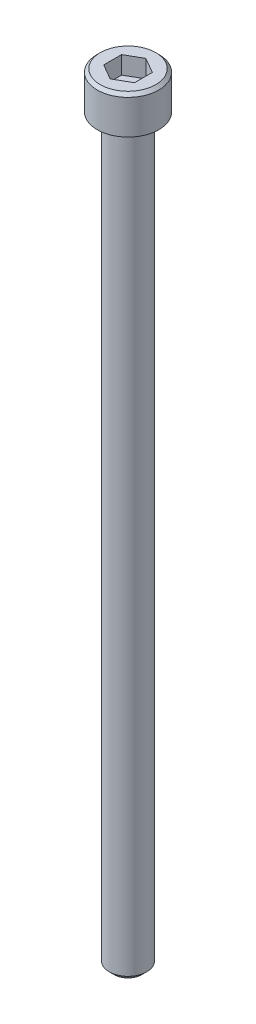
from build123d import *

# Parameters (mm, degrees)
CUT_EXTRUDE1_DEPTH = 2.286


with BuildPart() as part:
    # Sketch1 → Base-Revolve (revolve)
    with BuildSketch(Plane.XY, mode=Mode.PRIVATE) as base_revolve_sk:
        Polygon((0, 0), (3.96875, 0), (3.96875, 4.429125), (3.571875, 4.826), (0, 4.826), align=None)
    revolve(base_revolve_sk.sketch.rotate(Axis((0, 0, 0), (0, 1, 0)), 90), axis=Axis((0, 0, 0), (0, 1, 0)))

    # Sketch2 → Boss-Revolve1 (revolve)
    with BuildSketch(Plane.XY, mode=Mode.PRIVATE) as boss_revolve1_sk:
        Polygon((0, -95.25), (1.78308, -95.25), (2.413, -94.62008), (2.413, 0), (0, 0), align=None)
    revolve(boss_revolve1_sk.sketch.rotate(Axis((0, 0, 0), (0, 1, 0)), 90), axis=Axis((0, 0, 0), (0, 1, 0)))

    # Sketch3 → Cut-Extrude1 (cut)
    with BuildSketch(Plane(origin=(0, 4.826, 0), x_dir=(-1, 0, 0), z_dir=(0, 1, 0))):
        Polygon((1.98501, 1.146046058), (0, 2.292092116), (-1.98501, 1.146046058), (-1.98501, -1.146046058), (0, -2.292092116), (1.98501, -1.146046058), align=None)
    extrude(amount=-CUT_EXTRUDE1_DEPTH, mode=Mode.SUBTRACT)


solid = part.part
